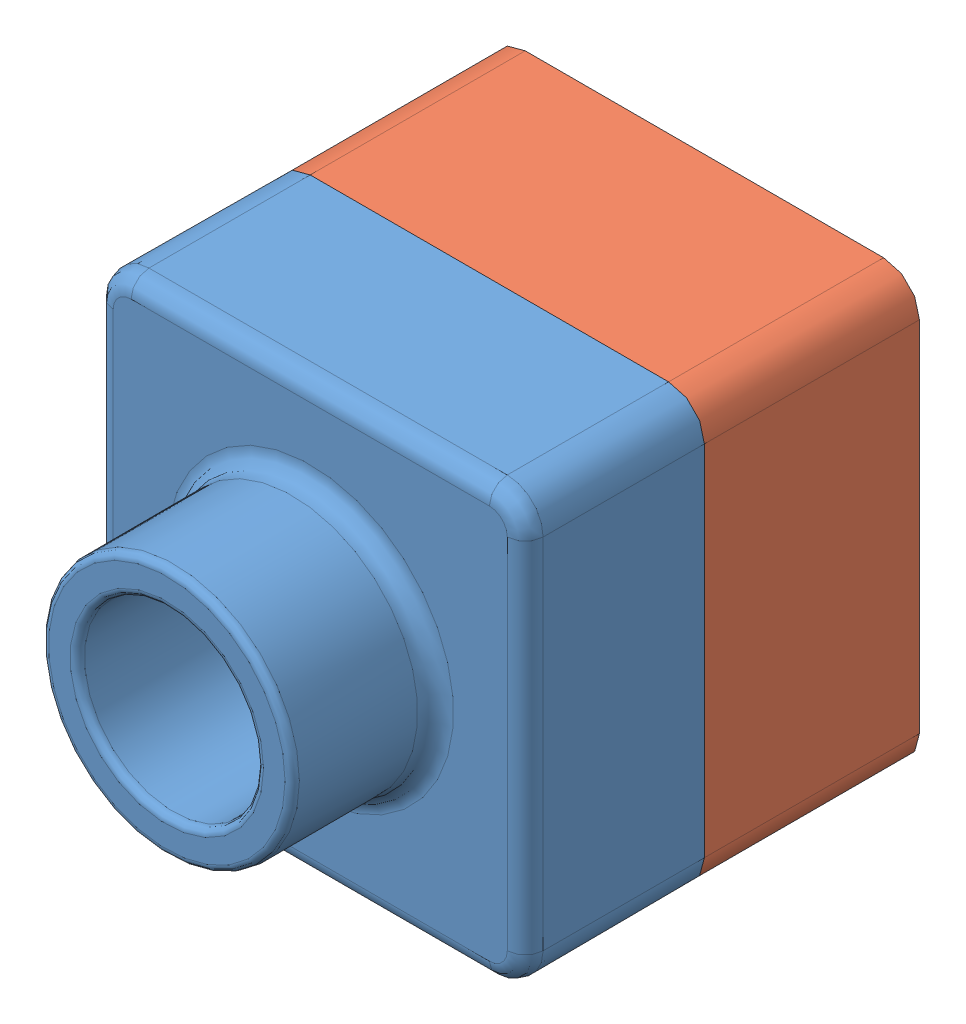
SolidWorks assembly tutor.SLDASM, configuration Default (file format 4100). Lengths in mm.
Overall size (120 120 150).
2 component instances, 2 part files, 3 mates.
Components (placement in the parent):
- tutor1-1: tutor1.sldprt [Default] at origin size (120 120 90)
- tutor2-1: tutor2.SLDPRT [Default] at (0 0 -60) size (120 120 90)
Mates (geometry in assembly coordinates):
- Coincident1: coincident aligned: line of tutor1-1 through (110 120 0) axis (-1 0 0); line of tutor2-1 through (110 120 0) axis (-1 0 0)
- Coincident2: coincident aligned: plane of tutor1-1 through (0 120 50) normal (0 1 0); plane of tutor2-1 through (0 120 30) normal (0 1 0)
- Coincident3: coincident aligned: plane of tutor1-1 through (120 0 50) normal (1 0 0); plane of tutor2-1 through (120 0 30) normal (1 0 0)
